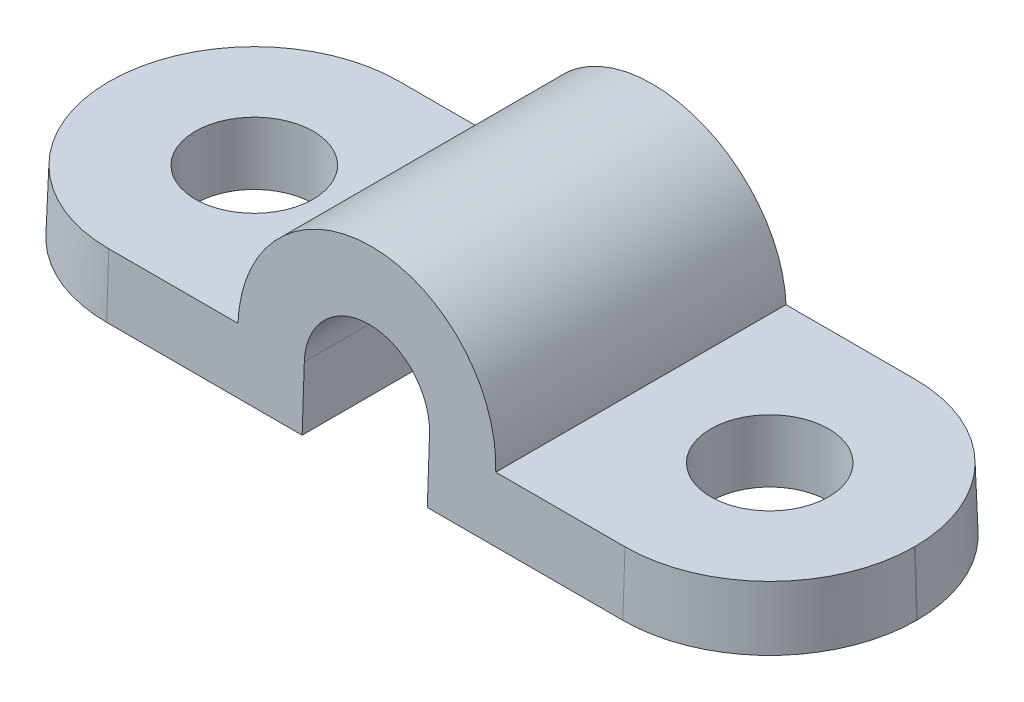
ISO-10303-21;
HEADER;
FILE_DESCRIPTION(('STEP AP214'),'2;1');
FILE_NAME('part.step','',(''),(''),'','','');
FILE_SCHEMA(('AUTOMOTIVE_DESIGN { 1 0 10303 214 1 1 1 1 }'));
ENDSEC;
DATA;
#1=APPLICATION_CONTEXT('core data for automotive mechanical design processes');
#2=APPLICATION_PROTOCOL_DEFINITION('international standard','automotive_design',2000,#1);
#3=PRODUCT_CONTEXT('',#1,'mechanical');
#4=PRODUCT('Part','Part','',(#3));
#5=PRODUCT_RELATED_PRODUCT_CATEGORY('part','',(#4));
#6=PRODUCT_DEFINITION_FORMATION('','',#4);
#7=PRODUCT_DEFINITION_CONTEXT('part definition',#1,'design');
#8=PRODUCT_DEFINITION('design','',#6,#7);
#9=PRODUCT_DEFINITION_SHAPE('','',#8);
#10=(LENGTH_UNIT() NAMED_UNIT(*) SI_UNIT(.MILLI.,.METRE.));
#11=(NAMED_UNIT(*) PLANE_ANGLE_UNIT() SI_UNIT($,.RADIAN.));
#12=(NAMED_UNIT(*) SI_UNIT($,.STERADIAN.) SOLID_ANGLE_UNIT());
#13=UNCERTAINTY_MEASURE_WITH_UNIT(LENGTH_MEASURE(1.E-05),#10,'distance_accuracy_value','');
#14=(GEOMETRIC_REPRESENTATION_CONTEXT(3) GLOBAL_UNCERTAINTY_ASSIGNED_CONTEXT((#13)) GLOBAL_UNIT_ASSIGNED_CONTEXT((#10,
#11,#12)) REPRESENTATION_CONTEXT('',''));
#15=CARTESIAN_POINT('',(0.,0.,0.));
#16=DIRECTION('',(0.,0.,1.));
#17=DIRECTION('',(1.,0.,0.));
#18=AXIS2_PLACEMENT_3D('',#15,#16,#17);
#19=CARTESIAN_POINT('',(-11.,1.7,4.));
#20=DIRECTION('',(0.,-1.,0.));
#21=DIRECTION('',(0.,0.,-1.));
#22=AXIS2_PLACEMENT_3D('',#19,#20,#21);
#23=PLANE('',#22);
#24=DIRECTION('',(0.,0.,1.));
#25=VECTOR('',#24,1.);
#26=CARTESIAN_POINT('',(-10.940634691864,1.7,4.));
#27=LINE('',#26,#25);
#28=CARTESIAN_POINT('',(-10.940634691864,1.7,0.00999999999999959));
#29=VERTEX_POINT('',#28);
#30=CARTESIAN_POINT('',(-10.940634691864,1.7,-0.00999999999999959));
#31=VERTEX_POINT('',#30);
#32=EDGE_CURVE('E183',#29,#31,#27,.F.);
#33=ORIENTED_EDGE('',*,*,#32,.F.);
#34=CARTESIAN_POINT('',(-7.01,1.7,0.00999999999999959));
#35=DIRECTION('',(0.,-1.,0.));
#36=DIRECTION('',(0.,0.,-1.));
#37=AXIS2_PLACEMENT_3D('',#34,#35,#36);
#38=CIRCLE('',#37,3.93063469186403);
#39=CARTESIAN_POINT('',(-7.01,1.7,3.94063469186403));
#40=VERTEX_POINT('',#39);
#41=EDGE_CURVE('E207',#29,#40,#38,.F.);
#42=ORIENTED_EDGE('',*,*,#41,.T.);
#43=DIRECTION('',(-1.,0.,0.));
#44=VECTOR('',#43,1.);
#45=CARTESIAN_POINT('',(-11.,1.7,3.94063469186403));
#46=LINE('',#45,#44);
#47=CARTESIAN_POINT('',(-3.5,1.7,3.94063469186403));
#48=VERTEX_POINT('',#47);
#49=EDGE_CURVE('E160',#48,#40,#46,.T.);
#50=ORIENTED_EDGE('',*,*,#49,.F.);
#51=DIRECTION('',(0.,0.,-1.));
#52=VECTOR('',#51,1.);
#53=CARTESIAN_POINT('',(-3.5,1.7,4.));
#54=LINE('',#53,#52);
#55=CARTESIAN_POINT('',(-3.5,1.7,-3.94063469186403));
#56=VERTEX_POINT('',#55);
#57=EDGE_CURVE('E227',#48,#56,#54,.T.);
#58=ORIENTED_EDGE('',*,*,#57,.T.);
#59=DIRECTION('',(1.,0.,0.));
#60=VECTOR('',#59,1.);
#61=CARTESIAN_POINT('',(-11.,1.7,-3.94063469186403));
#62=LINE('',#61,#60);
#63=CARTESIAN_POINT('',(-7.01,1.7,-3.94063469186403));
#64=VERTEX_POINT('',#63);
#65=EDGE_CURVE('E187',#56,#64,#62,.F.);
#66=ORIENTED_EDGE('',*,*,#65,.T.);
#67=CARTESIAN_POINT('',(-7.01,1.7,-0.00999999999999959));
#68=DIRECTION('',(0.,-1.,0.));
#69=DIRECTION('',(0.,0.,-1.));
#70=AXIS2_PLACEMENT_3D('',#67,#68,#69);
#71=CIRCLE('',#70,3.93063469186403);
#72=EDGE_CURVE('E200',#64,#31,#71,.F.);
#73=ORIENTED_EDGE('',*,*,#72,.T.);
#74=EDGE_LOOP('',(#33,#42,#50,#58,#66,#73));
#75=FACE_BOUND('',#74,.T.);
#76=CARTESIAN_POINT('',(-7.,1.7,0.));
#77=DIRECTION('',(0.,-1.,0.));
#78=DIRECTION('',(0.,0.,-1.));
#79=AXIS2_PLACEMENT_3D('',#76,#77,#78);
#80=CIRCLE('',#79,1.6);
#81=CARTESIAN_POINT('',(-7.,1.7,-1.6));
#82=VERTEX_POINT('',#81);
#83=EDGE_CURVE('E317',#82,#82,#80,.F.);
#84=ORIENTED_EDGE('',*,*,#83,.F.);
#85=EDGE_LOOP('',(#84));
#86=FACE_BOUND('',#85,.T.);
#87=ADVANCED_FACE('F24',(#75,#86),#23,.F.);
#88=CARTESIAN_POINT('',(-11.,0.,4.));
#89=DIRECTION('',(0.,1.,0.));
#90=DIRECTION('',(0.,0.,1.));
#91=AXIS2_PLACEMENT_3D('',#88,#89,#90);
#92=PLANE('',#91);
#93=DIRECTION('',(1.,0.,0.));
#94=VECTOR('',#93,1.);
#95=CARTESIAN_POINT('',(-11.,0.,4.));
#96=LINE('',#95,#94);
#97=CARTESIAN_POINT('',(-7.01,0.,4.));
#98=VERTEX_POINT('',#97);
#99=CARTESIAN_POINT('',(-1.70000000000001,0.,4.));
#100=VERTEX_POINT('',#99);
#101=EDGE_CURVE('E178',#98,#100,#96,.T.);
#102=ORIENTED_EDGE('',*,*,#101,.F.);
#103=CARTESIAN_POINT('',(-7.01,0.,0.00999999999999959));
#104=DIRECTION('',(0.,1.,0.));
#105=DIRECTION('',(0.,0.,1.));
#106=AXIS2_PLACEMENT_3D('',#103,#104,#105);
#107=CIRCLE('',#106,3.99);
#108=CARTESIAN_POINT('',(-11.,0.,0.00999999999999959));
#109=VERTEX_POINT('',#108);
#110=EDGE_CURVE('E210',#98,#109,#107,.F.);
#111=ORIENTED_EDGE('',*,*,#110,.T.);
#112=DIRECTION('',(0.,0.,1.));
#113=VECTOR('',#112,1.);
#114=CARTESIAN_POINT('',(-11.,0.,4.));
#115=LINE('',#114,#113);
#116=CARTESIAN_POINT('',(-11.,0.,-0.00999999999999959));
#117=VERTEX_POINT('',#116);
#118=EDGE_CURVE('E180',#109,#117,#115,.F.);
#119=ORIENTED_EDGE('',*,*,#118,.T.);
#120=CARTESIAN_POINT('',(-7.01,0.,-0.00999999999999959));
#121=DIRECTION('',(0.,1.,0.));
#122=DIRECTION('',(0.,0.,1.));
#123=AXIS2_PLACEMENT_3D('',#120,#121,#122);
#124=CIRCLE('',#123,3.99);
#125=CARTESIAN_POINT('',(-7.01,0.,-4.));
#126=VERTEX_POINT('',#125);
#127=EDGE_CURVE('E213',#117,#126,#124,.F.);
#128=ORIENTED_EDGE('',*,*,#127,.T.);
#129=DIRECTION('',(-1.,0.,0.));
#130=VECTOR('',#129,1.);
#131=CARTESIAN_POINT('',(-11.,0.,-4.));
#132=LINE('',#131,#130);
#133=CARTESIAN_POINT('',(-1.70000000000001,0.,-4.));
#134=VERTEX_POINT('',#133);
#135=EDGE_CURVE('E185',#126,#134,#132,.F.);
#136=ORIENTED_EDGE('',*,*,#135,.T.);
#137=DIRECTION('',(0.,0.,-1.));
#138=VECTOR('',#137,1.);
#139=CARTESIAN_POINT('',(-1.70000000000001,0.,4.));
#140=LINE('',#139,#138);
#141=EDGE_CURVE('E184',#100,#134,#140,.T.);
#142=ORIENTED_EDGE('',*,*,#141,.F.);
#143=EDGE_LOOP('',(#102,#111,#119,#128,#136,#142));
#144=FACE_BOUND('',#143,.T.);
#145=CARTESIAN_POINT('',(-7.,0.,0.));
#146=DIRECTION('',(0.,1.,0.));
#147=DIRECTION('',(0.,0.,-1.));
#148=AXIS2_PLACEMENT_3D('',#145,#146,#147);
#149=CIRCLE('',#148,1.6);
#150=CARTESIAN_POINT('',(-7.,0.,-1.6));
#151=VERTEX_POINT('',#150);
#152=EDGE_CURVE('E319',#151,#151,#149,.T.);
#153=ORIENTED_EDGE('',*,*,#152,.T.);
#154=EDGE_LOOP('',(#153));
#155=FACE_BOUND('',#154,.T.);
#156=ADVANCED_FACE('F278',(#144,#155),#92,.F.);
#157=CARTESIAN_POINT('',(1.7,0.,4.));
#158=DIRECTION('',(0.,1.,0.));
#159=DIRECTION('',(0.,0.,1.));
#160=AXIS2_PLACEMENT_3D('',#157,#158,#159);
#161=PLANE('',#160);
#162=DIRECTION('',(0.,0.,1.));
#163=VECTOR('',#162,1.);
#164=CARTESIAN_POINT('',(11.,0.,4.));
#165=LINE('',#164,#163);
#166=CARTESIAN_POINT('',(11.,0.,0.00999999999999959));
#167=VERTEX_POINT('',#166);
#168=CARTESIAN_POINT('',(11.,0.,-0.00999999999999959));
#169=VERTEX_POINT('',#168);
#170=EDGE_CURVE('E166',#167,#169,#165,.F.);
#171=ORIENTED_EDGE('',*,*,#170,.F.);
#172=CARTESIAN_POINT('',(7.01,0.,0.00999999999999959));
#173=DIRECTION('',(0.,1.,0.));
#174=DIRECTION('',(0.,0.,1.));
#175=AXIS2_PLACEMENT_3D('',#172,#173,#174);
#176=CIRCLE('',#175,3.99);
#177=CARTESIAN_POINT('',(7.01,0.,4.));
#178=VERTEX_POINT('',#177);
#179=EDGE_CURVE('E11',#167,#178,#176,.F.);
#180=ORIENTED_EDGE('',*,*,#179,.T.);
#181=DIRECTION('',(1.,0.,0.));
#182=VECTOR('',#181,1.);
#183=CARTESIAN_POINT('',(1.7,0.,4.));
#184=LINE('',#183,#182);
#185=CARTESIAN_POINT('',(1.7,0.,4.));
#186=VERTEX_POINT('',#185);
#187=EDGE_CURVE('E149',#186,#178,#184,.T.);
#188=ORIENTED_EDGE('',*,*,#187,.F.);
#189=DIRECTION('',(0.,0.,-1.));
#190=VECTOR('',#189,1.);
#191=CARTESIAN_POINT('',(1.7,0.,4.));
#192=LINE('',#191,#190);
#193=CARTESIAN_POINT('',(1.7,0.,-4.));
#194=VERTEX_POINT('',#193);
#195=EDGE_CURVE('E167',#186,#194,#192,.T.);
#196=ORIENTED_EDGE('',*,*,#195,.T.);
#197=DIRECTION('',(-1.,0.,0.));
#198=VECTOR('',#197,1.);
#199=CARTESIAN_POINT('',(1.7,0.,-4.));
#200=LINE('',#199,#198);
#201=CARTESIAN_POINT('',(7.01,0.,-4.));
#202=VERTEX_POINT('',#201);
#203=EDGE_CURVE('E195',#194,#202,#200,.F.);
#204=ORIENTED_EDGE('',*,*,#203,.T.);
#205=CARTESIAN_POINT('',(7.01,0.,-0.00999999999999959));
#206=DIRECTION('',(0.,1.,0.));
#207=DIRECTION('',(0.,0.,1.));
#208=AXIS2_PLACEMENT_3D('',#205,#206,#207);
#209=CIRCLE('',#208,3.99);
#210=EDGE_CURVE('E33',#202,#169,#209,.F.);
#211=ORIENTED_EDGE('',*,*,#210,.T.);
#212=EDGE_LOOP('',(#171,#180,#188,#196,#204,#211));
#213=FACE_BOUND('',#212,.T.);
#214=CARTESIAN_POINT('',(7.,0.,0.));
#215=DIRECTION('',(0.,1.,0.));
#216=DIRECTION('',(0.,0.,1.));
#217=AXIS2_PLACEMENT_3D('',#214,#215,#216);
#218=CIRCLE('',#217,1.6);
#219=CARTESIAN_POINT('',(7.,0.,1.6));
#220=VERTEX_POINT('',#219);
#221=EDGE_CURVE('E256',#220,#220,#218,.T.);
#222=ORIENTED_EDGE('',*,*,#221,.T.);
#223=EDGE_LOOP('',(#222));
#224=FACE_BOUND('',#223,.T.);
#225=ADVANCED_FACE('F283',(#213,#224),#161,.F.);
#226=CARTESIAN_POINT('',(3.5,1.7,4.));
#227=DIRECTION('',(0.,-1.,0.));
#228=DIRECTION('',(0.,0.,-1.));
#229=AXIS2_PLACEMENT_3D('',#226,#227,#228);
#230=PLANE('',#229);
#231=DIRECTION('',(-1.,0.,0.));
#232=VECTOR('',#231,1.);
#233=CARTESIAN_POINT('',(3.5,1.7,3.94063469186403));
#234=LINE('',#233,#232);
#235=CARTESIAN_POINT('',(7.01,1.7,3.94063469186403));
#236=VERTEX_POINT('',#235);
#237=CARTESIAN_POINT('',(3.5,1.7,3.94063469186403));
#238=VERTEX_POINT('',#237);
#239=EDGE_CURVE('E146',#236,#238,#234,.T.);
#240=ORIENTED_EDGE('',*,*,#239,.F.);
#241=CARTESIAN_POINT('',(7.01,1.7,0.00999999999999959));
#242=DIRECTION('',(0.,-1.,0.));
#243=DIRECTION('',(0.,0.,-1.));
#244=AXIS2_PLACEMENT_3D('',#241,#242,#243);
#245=CIRCLE('',#244,3.93063469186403);
#246=CARTESIAN_POINT('',(10.940634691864,1.7,0.00999999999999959));
#247=VERTEX_POINT('',#246);
#248=EDGE_CURVE('E134',#236,#247,#245,.F.);
#249=ORIENTED_EDGE('',*,*,#248,.T.);
#250=DIRECTION('',(0.,0.,1.));
#251=VECTOR('',#250,1.);
#252=CARTESIAN_POINT('',(10.940634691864,1.7,4.));
#253=LINE('',#252,#251);
#254=CARTESIAN_POINT('',(10.940634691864,1.7,-0.00999999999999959));
#255=VERTEX_POINT('',#254);
#256=EDGE_CURVE('E168',#247,#255,#253,.F.);
#257=ORIENTED_EDGE('',*,*,#256,.T.);
#258=CARTESIAN_POINT('',(7.01,1.7,-0.00999999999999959));
#259=DIRECTION('',(0.,-1.,0.));
#260=DIRECTION('',(0.,0.,-1.));
#261=AXIS2_PLACEMENT_3D('',#258,#259,#260);
#262=CIRCLE('',#261,3.93063469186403);
#263=CARTESIAN_POINT('',(7.01,1.7,-3.94063469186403));
#264=VERTEX_POINT('',#263);
#265=EDGE_CURVE('E114',#255,#264,#262,.F.);
#266=ORIENTED_EDGE('',*,*,#265,.T.);
#267=DIRECTION('',(1.,0.,0.));
#268=VECTOR('',#267,1.);
#269=CARTESIAN_POINT('',(3.5,1.7,-3.94063469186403));
#270=LINE('',#269,#268);
#271=CARTESIAN_POINT('',(3.5,1.7,-3.94063469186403));
#272=VERTEX_POINT('',#271);
#273=EDGE_CURVE('E197',#264,#272,#270,.F.);
#274=ORIENTED_EDGE('',*,*,#273,.T.);
#275=DIRECTION('',(0.,0.,-1.));
#276=VECTOR('',#275,1.);
#277=CARTESIAN_POINT('',(3.5,1.7,4.));
#278=LINE('',#277,#276);
#279=EDGE_CURVE('E156',#238,#272,#278,.T.);
#280=ORIENTED_EDGE('',*,*,#279,.F.);
#281=EDGE_LOOP('',(#240,#249,#257,#266,#274,#280));
#282=FACE_BOUND('',#281,.T.);
#283=CARTESIAN_POINT('',(7.,1.7,0.));
#284=DIRECTION('',(0.,-1.,0.));
#285=DIRECTION('',(0.,0.,-1.));
#286=AXIS2_PLACEMENT_3D('',#283,#284,#285);
#287=CIRCLE('',#286,1.6);
#288=CARTESIAN_POINT('',(7.,1.7,-1.6));
#289=VERTEX_POINT('',#288);
#290=EDGE_CURVE('E193',#289,#289,#287,.F.);
#291=ORIENTED_EDGE('',*,*,#290,.F.);
#292=EDGE_LOOP('',(#291));
#293=FACE_BOUND('',#292,.T.);
#294=ADVANCED_FACE('F153',(#282,#293),#230,.F.);
#295=CARTESIAN_POINT('',(0.,1.7,4.));
#296=DIRECTION('',(0.,0.,-1.));
#297=DIRECTION('',(-1.,0.,0.));
#298=AXIS2_PLACEMENT_3D('',#295,#296,#297);
#299=CYLINDRICAL_SURFACE('',#298,1.7);
#300=CARTESIAN_POINT('',(0.,1.7,-3.94063469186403));
#301=DIRECTION('',(0.,0.034899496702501,-0.999390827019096));
#302=DIRECTION('',(0.,-0.999390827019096,-0.034899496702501));
#303=AXIS2_PLACEMENT_3D('',#300,#301,#302);
#304=ELLIPSE('',#303,1.701036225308,1.7);
#305=CARTESIAN_POINT('',(-1.7,1.7,-3.94063469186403));
#306=VERTEX_POINT('',#305);
#307=CARTESIAN_POINT('',(1.7,1.7,-3.94063469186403));
#308=VERTEX_POINT('',#307);
#309=EDGE_CURVE('E189',#306,#308,#304,.T.);
#310=ORIENTED_EDGE('',*,*,#309,.T.);
#311=DIRECTION('',(0.,0.,-1.));
#312=VECTOR('',#311,1.);
#313=CARTESIAN_POINT('',(1.7,1.7,4.));
#314=LINE('',#313,#312);
#315=CARTESIAN_POINT('',(1.7,1.7,3.94063469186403));
#316=VERTEX_POINT('',#315);
#317=EDGE_CURVE('E151',#316,#308,#314,.T.);
#318=ORIENTED_EDGE('',*,*,#317,.F.);
#319=CARTESIAN_POINT('',(0.,1.7,3.94063469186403));
#320=DIRECTION('',(0.,0.034899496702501,0.999390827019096));
#321=DIRECTION('',(0.,0.999390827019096,-0.034899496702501));
#322=AXIS2_PLACEMENT_3D('',#319,#320,#321);
#323=ELLIPSE('',#322,1.701036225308,1.7);
#324=CARTESIAN_POINT('',(-1.7,1.7,3.94063469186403));
#325=VERTEX_POINT('',#324);
#326=EDGE_CURVE('E171',#325,#316,#323,.F.);
#327=ORIENTED_EDGE('',*,*,#326,.F.);
#328=DIRECTION('',(0.,0.,-1.));
#329=VECTOR('',#328,1.);
#330=CARTESIAN_POINT('',(-1.7,1.7,4.));
#331=LINE('',#330,#329);
#332=EDGE_CURVE('E177',#325,#306,#331,.T.);
#333=ORIENTED_EDGE('',*,*,#332,.T.);
#334=EDGE_LOOP('',(#310,#318,#327,#333));
#335=FACE_BOUND('',#334,.T.);
#336=ADVANCED_FACE('F293',(#335),#299,.F.);
#337=CARTESIAN_POINT('',(1.7,1.7,4.));
#338=DIRECTION('',(1.,0.,0.));
#339=DIRECTION('',(0.,1.,0.));
#340=AXIS2_PLACEMENT_3D('',#337,#338,#339);
#341=PLANE('',#340);
#342=DIRECTION('',(0.,0.999390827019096,0.034899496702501));
#343=VECTOR('',#342,1.);
#344=CARTESIAN_POINT('',(1.7,1.97695533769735,-3.93096319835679));
#345=LINE('',#344,#343);
#346=EDGE_CURVE('E192',#308,#194,#345,.F.);
#347=ORIENTED_EDGE('',*,*,#346,.T.);
#348=ORIENTED_EDGE('',*,*,#195,.F.);
#349=DIRECTION('',(0.,-0.999390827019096,0.034899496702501));
#350=VECTOR('',#349,1.);
#351=CARTESIAN_POINT('',(1.7,1.69792944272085,3.94070699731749));
#352=LINE('',#351,#350);
#353=EDGE_CURVE('E162',#316,#186,#352,.T.);
#354=ORIENTED_EDGE('',*,*,#353,.F.);
#355=ORIENTED_EDGE('',*,*,#317,.T.);
#356=EDGE_LOOP('',(#347,#348,#354,#355));
#357=FACE_BOUND('',#356,.T.);
#358=ADVANCED_FACE('F296',(#357),#341,.F.);
#359=CARTESIAN_POINT('',(11.,0.,4.));
#360=DIRECTION('',(0.999390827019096,0.034899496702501,0.));
#361=DIRECTION('',(-0.034899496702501,0.999390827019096,0.));
#362=AXIS2_PLACEMENT_3D('',#359,#360,#361);
#363=PLANE('',#362);
#364=ORIENTED_EDGE('',*,*,#256,.F.);
#365=DIRECTION('',(0.0348994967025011,-0.999390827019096,0.));
#366=VECTOR('',#365,1.);
#367=CARTESIAN_POINT('',(11.,0.,0.00999999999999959));
#368=LINE('',#367,#366);
#369=EDGE_CURVE('E48',#247,#167,#368,.T.);
#370=ORIENTED_EDGE('',*,*,#369,.T.);
#371=ORIENTED_EDGE('',*,*,#170,.T.);
#372=DIRECTION('',(0.0348994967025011,-0.999390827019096,0.));
#373=VECTOR('',#372,1.);
#374=CARTESIAN_POINT('',(11.,0.,-0.00999999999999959));
#375=LINE('',#374,#373);
#376=EDGE_CURVE('E140',#169,#255,#375,.F.);
#377=ORIENTED_EDGE('',*,*,#376,.T.);
#378=EDGE_LOOP('',(#364,#370,#371,#377));
#379=FACE_BOUND('',#378,.T.);
#380=ADVANCED_FACE('F290',(#379),#363,.T.);
#381=CARTESIAN_POINT('',(0.,1.7,4.));
#382=DIRECTION('',(0.,0.,-1.));
#383=DIRECTION('',(-1.,0.,0.));
#384=AXIS2_PLACEMENT_3D('',#381,#382,#383);
#385=CYLINDRICAL_SURFACE('',#384,3.5);
#386=CARTESIAN_POINT('',(0.,1.7,-3.94063469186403));
#387=DIRECTION('',(0.,0.034899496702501,-0.999390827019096));
#388=DIRECTION('',(0.,-0.999390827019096,-0.034899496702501));
#389=AXIS2_PLACEMENT_3D('',#386,#387,#388);
#390=ELLIPSE('',#389,3.50213340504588,3.5);
#391=EDGE_CURVE('E222',#272,#56,#390,.F.);
#392=ORIENTED_EDGE('',*,*,#391,.T.);
#393=ORIENTED_EDGE('',*,*,#57,.F.);
#394=CARTESIAN_POINT('',(0.,1.7,3.94063469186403));
#395=DIRECTION('',(0.,0.034899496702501,0.999390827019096));
#396=DIRECTION('',(0.,0.999390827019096,-0.034899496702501));
#397=AXIS2_PLACEMENT_3D('',#394,#395,#396);
#398=ELLIPSE('',#397,3.50213340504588,3.5);
#399=EDGE_CURVE('E158',#238,#48,#398,.T.);
#400=ORIENTED_EDGE('',*,*,#399,.F.);
#401=ORIENTED_EDGE('',*,*,#279,.T.);
#402=EDGE_LOOP('',(#392,#393,#400,#401));
#403=FACE_BOUND('',#402,.T.);
#404=ADVANCED_FACE('F260',(#403),#385,.T.);
#405=CARTESIAN_POINT('',(-11.,0.,4.));
#406=DIRECTION('',(-0.999390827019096,0.034899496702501,0.));
#407=DIRECTION('',(-0.034899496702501,-0.999390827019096,0.));
#408=AXIS2_PLACEMENT_3D('',#405,#406,#407);
#409=PLANE('',#408);
#410=ORIENTED_EDGE('',*,*,#118,.F.);
#411=DIRECTION('',(-0.0348994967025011,-0.999390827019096,0.));
#412=VECTOR('',#411,1.);
#413=CARTESIAN_POINT('',(-11.,0.,0.00999999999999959));
#414=LINE('',#413,#412);
#415=EDGE_CURVE('E199',#109,#29,#414,.F.);
#416=ORIENTED_EDGE('',*,*,#415,.T.);
#417=ORIENTED_EDGE('',*,*,#32,.T.);
#418=DIRECTION('',(-0.0348994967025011,-0.999390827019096,0.));
#419=VECTOR('',#418,1.);
#420=CARTESIAN_POINT('',(-11.,0.,-0.00999999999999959));
#421=LINE('',#420,#419);
#422=EDGE_CURVE('E201',#31,#117,#421,.T.);
#423=ORIENTED_EDGE('',*,*,#422,.T.);
#424=EDGE_LOOP('',(#410,#416,#417,#423));
#425=FACE_BOUND('',#424,.T.);
#426=ADVANCED_FACE('F289',(#425),#409,.T.);
#427=CARTESIAN_POINT('',(-1.7,1.7,4.));
#428=DIRECTION('',(-1.,0.,0.));
#429=DIRECTION('',(0.,-1.,0.));
#430=AXIS2_PLACEMENT_3D('',#427,#428,#429);
#431=PLANE('',#430);
#432=DIRECTION('',(0.,-0.999390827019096,-0.034899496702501));
#433=VECTOR('',#432,1.);
#434=CARTESIAN_POINT('',(-1.7,1.97695533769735,-3.93096319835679));
#435=LINE('',#434,#433);
#436=EDGE_CURVE('E174',#134,#306,#435,.F.);
#437=ORIENTED_EDGE('',*,*,#436,.T.);
#438=ORIENTED_EDGE('',*,*,#332,.F.);
#439=DIRECTION('',(0.,0.999390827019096,-0.034899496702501));
#440=VECTOR('',#439,1.);
#441=CARTESIAN_POINT('',(-1.7,1.69792944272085,3.94070699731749));
#442=LINE('',#441,#440);
#443=EDGE_CURVE('E175',#100,#325,#442,.T.);
#444=ORIENTED_EDGE('',*,*,#443,.F.);
#445=ORIENTED_EDGE('',*,*,#141,.T.);
#446=EDGE_LOOP('',(#437,#438,#444,#445));
#447=FACE_BOUND('',#446,.T.);
#448=ADVANCED_FACE('F305',(#447),#431,.F.);
#449=CARTESIAN_POINT('',(1.7,0.,4.));
#450=DIRECTION('',(0.,0.034899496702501,0.999390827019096));
#451=DIRECTION('',(0.,-0.999390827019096,0.034899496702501));
#452=AXIS2_PLACEMENT_3D('',#449,#450,#451);
#453=PLANE('',#452);
#454=ORIENTED_EDGE('',*,*,#49,.T.);
#455=DIRECTION('',(0.,-0.999390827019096,0.034899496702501));
#456=VECTOR('',#455,1.);
#457=CARTESIAN_POINT('',(-7.01,0.,4.));
#458=LINE('',#457,#456);
#459=EDGE_CURVE('E150',#40,#98,#458,.T.);
#460=ORIENTED_EDGE('',*,*,#459,.T.);
#461=ORIENTED_EDGE('',*,*,#101,.T.);
#462=ORIENTED_EDGE('',*,*,#443,.T.);
#463=ORIENTED_EDGE('',*,*,#326,.T.);
#464=ORIENTED_EDGE('',*,*,#353,.T.);
#465=ORIENTED_EDGE('',*,*,#187,.T.);
#466=DIRECTION('',(0.,-0.999390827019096,0.034899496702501));
#467=VECTOR('',#466,1.);
#468=CARTESIAN_POINT('',(7.01,0.,4.));
#469=LINE('',#468,#467);
#470=EDGE_CURVE('E138',#178,#236,#469,.F.);
#471=ORIENTED_EDGE('',*,*,#470,.T.);
#472=ORIENTED_EDGE('',*,*,#239,.T.);
#473=ORIENTED_EDGE('',*,*,#399,.T.);
#474=EDGE_LOOP('',(#454,#460,#461,#462,#463,#464,#465,#471,#472,#473));
#475=FACE_BOUND('',#474,.T.);
#476=ADVANCED_FACE('F145',(#475),#453,.T.);
#477=CARTESIAN_POINT('',(1.7,0.,-4.));
#478=DIRECTION('',(0.,0.034899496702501,-0.999390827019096));
#479=DIRECTION('',(0.,0.999390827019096,0.034899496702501));
#480=AXIS2_PLACEMENT_3D('',#477,#478,#479);
#481=PLANE('',#480);
#482=ORIENTED_EDGE('',*,*,#135,.F.);
#483=DIRECTION('',(0.,-0.999390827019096,-0.034899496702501));
#484=VECTOR('',#483,1.);
#485=CARTESIAN_POINT('',(-7.01,0.,-4.));
#486=LINE('',#485,#484);
#487=EDGE_CURVE('E28',#126,#64,#486,.F.);
#488=ORIENTED_EDGE('',*,*,#487,.T.);
#489=ORIENTED_EDGE('',*,*,#65,.F.);
#490=ORIENTED_EDGE('',*,*,#391,.F.);
#491=ORIENTED_EDGE('',*,*,#273,.F.);
#492=DIRECTION('',(0.,-0.999390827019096,-0.034899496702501));
#493=VECTOR('',#492,1.);
#494=CARTESIAN_POINT('',(7.01,0.,-4.));
#495=LINE('',#494,#493);
#496=EDGE_CURVE('E106',#264,#202,#495,.T.);
#497=ORIENTED_EDGE('',*,*,#496,.T.);
#498=ORIENTED_EDGE('',*,*,#203,.F.);
#499=ORIENTED_EDGE('',*,*,#346,.F.);
#500=ORIENTED_EDGE('',*,*,#309,.F.);
#501=ORIENTED_EDGE('',*,*,#436,.F.);
#502=EDGE_LOOP('',(#482,#488,#489,#490,#491,#497,#498,#499,#500,#501));
#503=FACE_BOUND('',#502,.T.);
#504=ADVANCED_FACE('F26',(#503),#481,.T.);
#505=CARTESIAN_POINT('',(7.,5.2,0.));
#506=DIRECTION('',(0.,-1.,0.));
#507=DIRECTION('',(0.,0.,-1.));
#508=AXIS2_PLACEMENT_3D('',#505,#506,#507);
#509=CYLINDRICAL_SURFACE('',#508,1.6);
#510=ORIENTED_EDGE('',*,*,#221,.F.);
#511=EDGE_LOOP('',(#510));
#512=FACE_BOUND('',#511,.T.);
#513=ORIENTED_EDGE('',*,*,#290,.T.);
#514=EDGE_LOOP('',(#513));
#515=FACE_BOUND('',#514,.T.);
#516=ADVANCED_FACE('F328',(#512,#515),#509,.F.);
#517=CARTESIAN_POINT('',(-7.,5.2,0.));
#518=DIRECTION('',(0.,-1.,0.));
#519=DIRECTION('',(0.,0.,-1.));
#520=AXIS2_PLACEMENT_3D('',#517,#518,#519);
#521=CYLINDRICAL_SURFACE('',#520,1.6);
#522=ORIENTED_EDGE('',*,*,#152,.F.);
#523=EDGE_LOOP('',(#522));
#524=FACE_BOUND('',#523,.T.);
#525=ORIENTED_EDGE('',*,*,#83,.T.);
#526=EDGE_LOOP('',(#525));
#527=FACE_BOUND('',#526,.T.);
#528=ADVANCED_FACE('F274',(#524,#527),#521,.F.);
#529=CARTESIAN_POINT('',(-7.01,0.,0.00999999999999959));
#530=DIRECTION('',(0.,-1.,0.));
#531=DIRECTION('',(0.,0.,1.));
#532=AXIS2_PLACEMENT_3D('',#529,#530,#531);
#533=CONICAL_SURFACE('',#532,3.99,0.0349065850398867);
#534=ORIENTED_EDGE('',*,*,#41,.F.);
#535=ORIENTED_EDGE('',*,*,#415,.F.);
#536=ORIENTED_EDGE('',*,*,#110,.F.);
#537=ORIENTED_EDGE('',*,*,#459,.F.);
#538=EDGE_LOOP('',(#534,#535,#536,#537));
#539=FACE_BOUND('',#538,.T.);
#540=ADVANCED_FACE('F237',(#539),#533,.T.);
#541=CARTESIAN_POINT('',(-7.01,0.,-0.00999999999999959));
#542=DIRECTION('',(0.,-1.,0.));
#543=DIRECTION('',(0.,0.,1.));
#544=AXIS2_PLACEMENT_3D('',#541,#542,#543);
#545=CONICAL_SURFACE('',#544,3.99,0.0349065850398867);
#546=ORIENTED_EDGE('',*,*,#72,.F.);
#547=ORIENTED_EDGE('',*,*,#487,.F.);
#548=ORIENTED_EDGE('',*,*,#127,.F.);
#549=ORIENTED_EDGE('',*,*,#422,.F.);
#550=EDGE_LOOP('',(#546,#547,#548,#549));
#551=FACE_BOUND('',#550,.T.);
#552=ADVANCED_FACE('F266',(#551),#545,.T.);
#553=CARTESIAN_POINT('',(7.01,0.,0.00999999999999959));
#554=DIRECTION('',(0.,-1.,0.));
#555=DIRECTION('',(0.,0.,1.));
#556=AXIS2_PLACEMENT_3D('',#553,#554,#555);
#557=CONICAL_SURFACE('',#556,3.99,0.0349065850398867);
#558=ORIENTED_EDGE('',*,*,#179,.F.);
#559=ORIENTED_EDGE('',*,*,#369,.F.);
#560=ORIENTED_EDGE('',*,*,#248,.F.);
#561=ORIENTED_EDGE('',*,*,#470,.F.);
#562=EDGE_LOOP('',(#558,#559,#560,#561));
#563=FACE_BOUND('',#562,.T.);
#564=ADVANCED_FACE('F137',(#563),#557,.T.);
#565=CARTESIAN_POINT('',(7.01,0.,-0.00999999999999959));
#566=DIRECTION('',(0.,-1.,0.));
#567=DIRECTION('',(0.,0.,1.));
#568=AXIS2_PLACEMENT_3D('',#565,#566,#567);
#569=CONICAL_SURFACE('',#568,3.99,0.0349065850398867);
#570=ORIENTED_EDGE('',*,*,#210,.F.);
#571=ORIENTED_EDGE('',*,*,#496,.F.);
#572=ORIENTED_EDGE('',*,*,#265,.F.);
#573=ORIENTED_EDGE('',*,*,#376,.F.);
#574=EDGE_LOOP('',(#570,#571,#572,#573));
#575=FACE_BOUND('',#574,.T.);
#576=ADVANCED_FACE('F272',(#575),#569,.T.);
#577=CLOSED_SHELL('',(#87,#156,#225,#294,#336,#358,#380,#404,#426,#448,#476,#504,#516,#528,#540,
#552,#564,#576));
#578=MANIFOLD_SOLID_BREP('B2',#577);
#579=ADVANCED_BREP_SHAPE_REPRESENTATION('',(#18,#578),#14);
#580=SHAPE_DEFINITION_REPRESENTATION(#9,#579);
ENDSEC;
END-ISO-10303-21;
